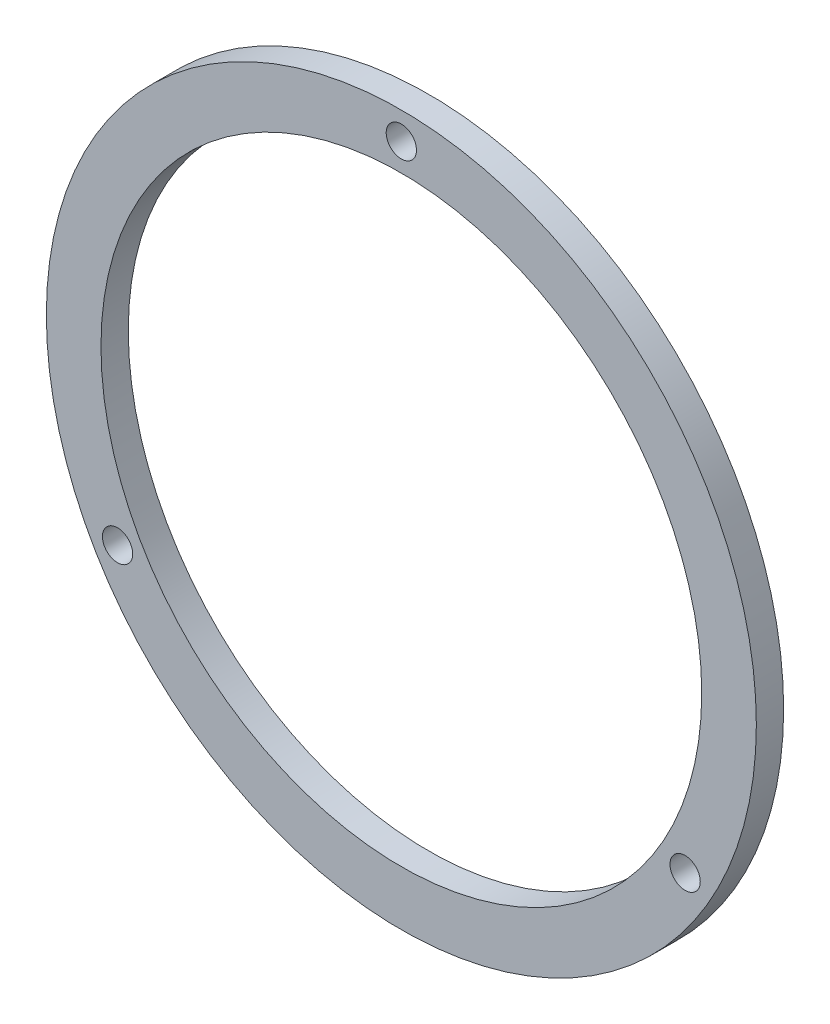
from build123d import *

# Parameters (mm, degrees)
SKETCH1_R                = 82.55
SKETCH1_R_2              = 69.85
BOSS_EXTRUDE1_DEPTH      = 6.35
J_0_277_DIAMETER_HOLE1_D = 7.0358


with BuildPart() as part:
    # Sketch1 → Boss-Extrude1 (new body)
    with BuildSketch(Plane.XY):
        Circle(SKETCH1_R)
        Circle(SKETCH1_R_2, mode=Mode.SUBTRACT)
    extrude(amount=BOSS_EXTRUDE1_DEPTH)

    # J _0.277_ Diameter Hole1 (through all)
    with Locations(Plane.XY.offset(6.35)):
        with Locations((0, 76.2), (65.991135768, -38.1), (-65.991135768, -38.1)):
            Hole(J_0_277_DIAMETER_HOLE1_D / 2)


solid = part.part
